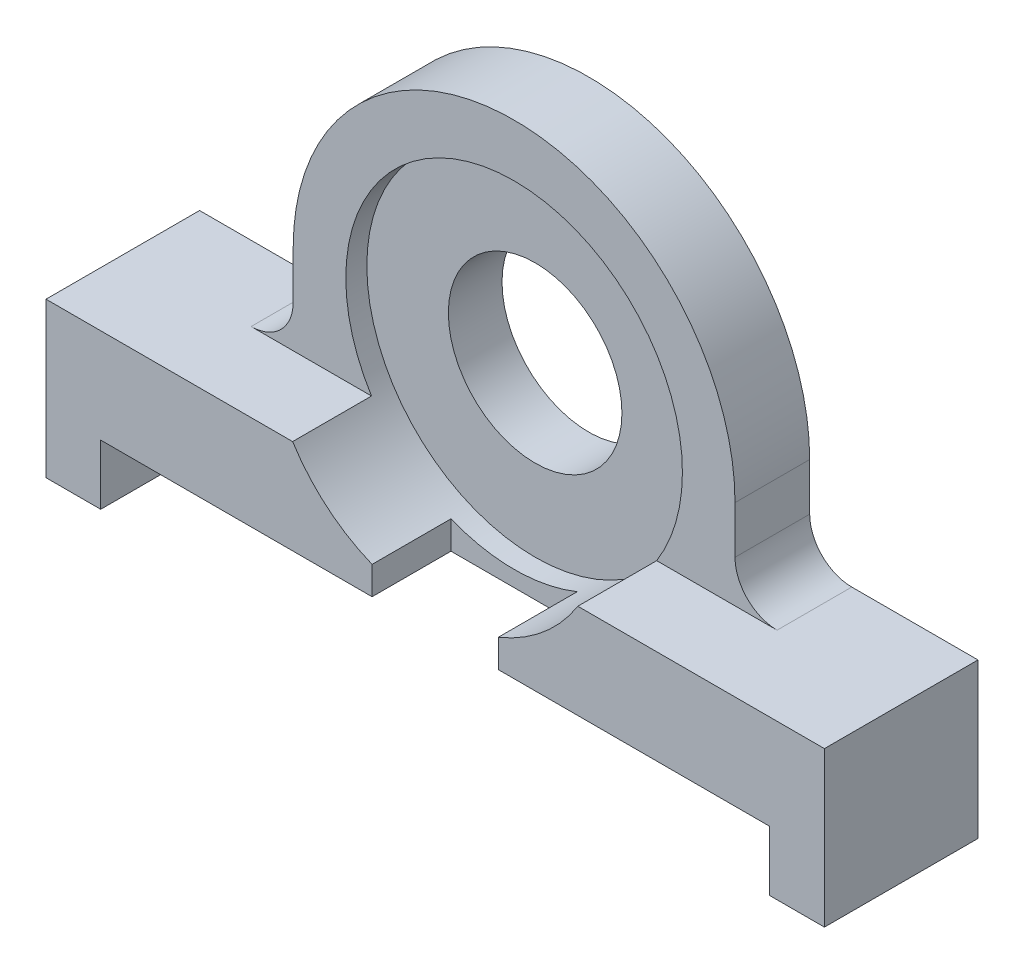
ISO-10303-21;
HEADER;
FILE_DESCRIPTION(('STEP AP214'),'2;1');
FILE_NAME('part.step','',(''),(''),'','','');
FILE_SCHEMA(('AUTOMOTIVE_DESIGN { 1 0 10303 214 1 1 1 1 }'));
ENDSEC;
DATA;
#1=APPLICATION_CONTEXT('core data for automotive mechanical design processes');
#2=APPLICATION_PROTOCOL_DEFINITION('international standard','automotive_design',2000,#1);
#3=PRODUCT_CONTEXT('',#1,'mechanical');
#4=PRODUCT('Part','Part','',(#3));
#5=PRODUCT_RELATED_PRODUCT_CATEGORY('part','',(#4));
#6=PRODUCT_DEFINITION_FORMATION('','',#4);
#7=PRODUCT_DEFINITION_CONTEXT('part definition',#1,'design');
#8=PRODUCT_DEFINITION('design','',#6,#7);
#9=PRODUCT_DEFINITION_SHAPE('','',#8);
#10=(LENGTH_UNIT() NAMED_UNIT(*) SI_UNIT(.MILLI.,.METRE.));
#11=(NAMED_UNIT(*) PLANE_ANGLE_UNIT() SI_UNIT($,.RADIAN.));
#12=(NAMED_UNIT(*) SI_UNIT($,.STERADIAN.) SOLID_ANGLE_UNIT());
#13=UNCERTAINTY_MEASURE_WITH_UNIT(LENGTH_MEASURE(1.E-05),#10,'distance_accuracy_value','');
#14=(GEOMETRIC_REPRESENTATION_CONTEXT(3) GLOBAL_UNCERTAINTY_ASSIGNED_CONTEXT((#13)) GLOBAL_UNIT_ASSIGNED_CONTEXT((#10,
#11,#12)) REPRESENTATION_CONTEXT('',''));
#15=CARTESIAN_POINT('',(0.,0.,0.));
#16=DIRECTION('',(0.,0.,1.));
#17=DIRECTION('',(1.,0.,0.));
#18=AXIS2_PLACEMENT_3D('',#15,#16,#17);
#19=CARTESIAN_POINT('',(0.,23.2,12.));
#20=DIRECTION('',(0.,0.,-1.));
#21=DIRECTION('',(-1.,0.,0.));
#22=AXIS2_PLACEMENT_3D('',#19,#20,#21);
#23=PLANE('',#22);
#24=DIRECTION('',(-1.,0.,0.));
#25=VECTOR('',#24,1.);
#26=CARTESIAN_POINT('',(-21.8,5.70000000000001,12.));
#27=LINE('',#26,#25);
#28=CARTESIAN_POINT('',(-6.,5.70000000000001,12.));
#29=VERTEX_POINT('',#28);
#30=CARTESIAN_POINT('',(-31.8,5.70000000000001,12.));
#31=VERTEX_POINT('',#30);
#32=EDGE_CURVE('E448',#29,#31,#27,.T.);
#33=ORIENTED_EDGE('',*,*,#32,.F.);
#34=DIRECTION('',(0.,-1.,0.));
#35=VECTOR('',#34,1.);
#36=CARTESIAN_POINT('',(-6.,5.70000000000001,12.));
#37=LINE('',#36,#35);
#38=CARTESIAN_POINT('',(-6.,8.36760302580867,12.));
#39=VERTEX_POINT('',#38);
#40=EDGE_CURVE('E344',#39,#29,#37,.T.);
#41=ORIENTED_EDGE('',*,*,#40,.F.);
#42=CARTESIAN_POINT('',(0.,23.2,12.));
#43=DIRECTION('',(0.,0.,1.));
#44=DIRECTION('',(1.,0.,0.));
#45=AXIS2_PLACEMENT_3D('',#42,#43,#44);
#46=CIRCLE('',#45,16.);
#47=CARTESIAN_POINT('',(-13.555441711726,14.7,12.));
#48=VERTEX_POINT('',#47);
#49=EDGE_CURVE('E493',#48,#39,#46,.T.);
#50=ORIENTED_EDGE('',*,*,#49,.F.);
#51=DIRECTION('',(-1.,0.,0.));
#52=VECTOR('',#51,1.);
#53=CARTESIAN_POINT('',(-21.,14.7,12.));
#54=LINE('',#53,#52);
#55=CARTESIAN_POINT('',(-37.,14.7,12.));
#56=VERTEX_POINT('',#55);
#57=EDGE_CURVE('E504',#48,#56,#54,.T.);
#58=ORIENTED_EDGE('',*,*,#57,.T.);
#59=DIRECTION('',(0.,-1.,0.));
#60=VECTOR('',#59,1.);
#61=CARTESIAN_POINT('',(-37.,14.7,12.));
#62=LINE('',#61,#60);
#63=CARTESIAN_POINT('',(-37.,0.,12.));
#64=VERTEX_POINT('',#63);
#65=EDGE_CURVE('E506',#56,#64,#62,.T.);
#66=ORIENTED_EDGE('',*,*,#65,.T.);
#67=DIRECTION('',(1.,0.,0.));
#68=VECTOR('',#67,1.);
#69=CARTESIAN_POINT('',(-37.,0.,12.));
#70=LINE('',#69,#68);
#71=CARTESIAN_POINT('',(-31.8,0.,12.));
#72=VERTEX_POINT('',#71);
#73=EDGE_CURVE('E497',#64,#72,#70,.T.);
#74=ORIENTED_EDGE('',*,*,#73,.T.);
#75=DIRECTION('',(0.,-1.,0.));
#76=VECTOR('',#75,1.);
#77=CARTESIAN_POINT('',(-31.8,0.,12.));
#78=LINE('',#77,#76);
#79=EDGE_CURVE('E366',#31,#72,#78,.T.);
#80=ORIENTED_EDGE('',*,*,#79,.F.);
#81=EDGE_LOOP('',(#33,#41,#50,#58,#66,#74,#80));
#82=FACE_BOUND('',#81,.T.);
#83=ADVANCED_FACE('F38',(#82),#23,.F.);
#84=CARTESIAN_POINT('',(21.,23.2,12.));
#85=DIRECTION('',(-1.,0.,0.));
#86=DIRECTION('',(0.,-1.,0.));
#87=AXIS2_PLACEMENT_3D('',#84,#85,#86);
#88=PLANE('',#87);
#89=DIRECTION('',(0.,-1.,0.));
#90=VECTOR('',#89,1.);
#91=CARTESIAN_POINT('',(21.,14.7,4.5));
#92=LINE('',#91,#90);
#93=CARTESIAN_POINT('',(21.,23.2,4.5));
#94=VERTEX_POINT('',#93);
#95=CARTESIAN_POINT('',(21.,18.7,4.5));
#96=VERTEX_POINT('',#95);
#97=EDGE_CURVE('E409',#94,#96,#92,.T.);
#98=ORIENTED_EDGE('',*,*,#97,.T.);
#99=DIRECTION('',(0.,0.,-1.));
#100=VECTOR('',#99,1.);
#101=CARTESIAN_POINT('',(21.,18.7,0.));
#102=LINE('',#101,#100);
#103=CARTESIAN_POINT('',(21.,18.7,-2.6));
#104=VERTEX_POINT('',#103);
#105=EDGE_CURVE('E540',#96,#104,#102,.T.);
#106=ORIENTED_EDGE('',*,*,#105,.T.);
#107=DIRECTION('',(0.,-1.,0.));
#108=VECTOR('',#107,1.);
#109=CARTESIAN_POINT('',(21.,18.7,-2.6));
#110=LINE('',#109,#108);
#111=CARTESIAN_POINT('',(21.,23.2,-2.6));
#112=VERTEX_POINT('',#111);
#113=EDGE_CURVE('E338',#112,#104,#110,.T.);
#114=ORIENTED_EDGE('',*,*,#113,.F.);
#115=DIRECTION('',(0.,0.,-1.));
#116=VECTOR('',#115,1.);
#117=CARTESIAN_POINT('',(21.,23.2,12.));
#118=LINE('',#117,#116);
#119=EDGE_CURVE('E514',#94,#112,#118,.T.);
#120=ORIENTED_EDGE('',*,*,#119,.F.);
#121=EDGE_LOOP('',(#98,#106,#114,#120));
#122=FACE_BOUND('',#121,.T.);
#123=ADVANCED_FACE('F556',(#122),#88,.F.);
#124=CARTESIAN_POINT('',(0.,23.2,12.));
#125=DIRECTION('',(0.,0.,-1.));
#126=DIRECTION('',(-1.,0.,0.));
#127=AXIS2_PLACEMENT_3D('',#124,#125,#126);
#128=CYLINDRICAL_SURFACE('',#127,21.);
#129=CARTESIAN_POINT('',(0.,23.2,4.5));
#130=DIRECTION('',(0.,0.,1.));
#131=DIRECTION('',(1.,0.,0.));
#132=AXIS2_PLACEMENT_3D('',#129,#130,#131);
#133=CIRCLE('',#132,21.);
#134=CARTESIAN_POINT('',(-21.,23.2,4.5));
#135=VERTEX_POINT('',#134);
#136=EDGE_CURVE('E385',#135,#94,#133,.F.);
#137=ORIENTED_EDGE('',*,*,#136,.T.);
#138=ORIENTED_EDGE('',*,*,#119,.T.);
#139=CARTESIAN_POINT('',(0.,23.2,-2.6));
#140=DIRECTION('',(0.,0.,-1.));
#141=DIRECTION('',(-1.,0.,0.));
#142=AXIS2_PLACEMENT_3D('',#139,#140,#141);
#143=CIRCLE('',#142,21.);
#144=CARTESIAN_POINT('',(-21.,23.2,-2.6));
#145=VERTEX_POINT('',#144);
#146=EDGE_CURVE('E335',#145,#112,#143,.T.);
#147=ORIENTED_EDGE('',*,*,#146,.F.);
#148=DIRECTION('',(0.,0.,-1.));
#149=VECTOR('',#148,1.);
#150=CARTESIAN_POINT('',(-21.,23.2,12.));
#151=LINE('',#150,#149);
#152=EDGE_CURVE('E512',#135,#145,#151,.T.);
#153=ORIENTED_EDGE('',*,*,#152,.F.);
#154=EDGE_LOOP('',(#137,#138,#147,#153));
#155=FACE_BOUND('',#154,.T.);
#156=ADVANCED_FACE('F659',(#155),#128,.T.);
#157=CARTESIAN_POINT('',(-21.,14.7,12.));
#158=DIRECTION('',(1.,0.,0.));
#159=DIRECTION('',(0.,0.,-1.));
#160=AXIS2_PLACEMENT_3D('',#157,#158,#159);
#161=PLANE('',#160);
#162=ORIENTED_EDGE('',*,*,#152,.T.);
#163=DIRECTION('',(0.,1.,0.));
#164=VECTOR('',#163,1.);
#165=CARTESIAN_POINT('',(-21.,23.2,-2.6));
#166=LINE('',#165,#164);
#167=CARTESIAN_POINT('',(-21.,18.7,-2.6));
#168=VERTEX_POINT('',#167);
#169=EDGE_CURVE('E332',#168,#145,#166,.T.);
#170=ORIENTED_EDGE('',*,*,#169,.F.);
#171=DIRECTION('',(0.,0.,-1.));
#172=VECTOR('',#171,1.);
#173=CARTESIAN_POINT('',(-21.,18.7,4.5));
#174=LINE('',#173,#172);
#175=CARTESIAN_POINT('',(-21.,18.7,4.5));
#176=VERTEX_POINT('',#175);
#177=EDGE_CURVE('E547',#168,#176,#174,.F.);
#178=ORIENTED_EDGE('',*,*,#177,.T.);
#179=DIRECTION('',(0.,1.,0.));
#180=VECTOR('',#179,1.);
#181=CARTESIAN_POINT('',(-21.,23.2,4.5));
#182=LINE('',#181,#180);
#183=EDGE_CURVE('E403',#176,#135,#182,.T.);
#184=ORIENTED_EDGE('',*,*,#183,.T.);
#185=EDGE_LOOP('',(#162,#170,#178,#184));
#186=FACE_BOUND('',#185,.T.);
#187=ADVANCED_FACE('F655',(#186),#161,.F.);
#188=CARTESIAN_POINT('',(37.,0.,12.));
#189=DIRECTION('',(0.,1.,0.));
#190=DIRECTION('',(-1.,0.,0.));
#191=AXIS2_PLACEMENT_3D('',#188,#189,#190);
#192=PLANE('',#191);
#193=CARTESIAN_POINT('',(-34.,0.,3.));
#194=DIRECTION('',(0.,-1.,0.));
#195=DIRECTION('',(1.,0.,0.));
#196=AXIS2_PLACEMENT_3D('',#193,#194,#195);
#197=CIRCLE('',#196,1.25);
#198=CARTESIAN_POINT('',(-32.75,0.,3.));
#199=VERTEX_POINT('',#198);
#200=EDGE_CURVE('E417',#199,#199,#197,.T.);
#201=ORIENTED_EDGE('',*,*,#200,.F.);
#202=EDGE_LOOP('',(#201));
#203=FACE_BOUND('',#202,.T.);
#204=CARTESIAN_POINT('',(-34.,0.,9.));
#205=DIRECTION('',(0.,-1.,0.));
#206=DIRECTION('',(1.,0.,0.));
#207=AXIS2_PLACEMENT_3D('',#204,#205,#206);
#208=CIRCLE('',#207,1.25);
#209=CARTESIAN_POINT('',(-32.75,0.,9.));
#210=VERTEX_POINT('',#209);
#211=EDGE_CURVE('E416',#210,#210,#208,.T.);
#212=ORIENTED_EDGE('',*,*,#211,.F.);
#213=EDGE_LOOP('',(#212));
#214=FACE_BOUND('',#213,.T.);
#215=DIRECTION('',(1.,0.,0.));
#216=VECTOR('',#215,1.);
#217=CARTESIAN_POINT('',(-21.8,0.,5.));
#218=LINE('',#217,#216);
#219=CARTESIAN_POINT('',(-31.8,0.,5.));
#220=VERTEX_POINT('',#219);
#221=CARTESIAN_POINT('',(-21.8,0.,5.));
#222=VERTEX_POINT('',#221);
#223=EDGE_CURVE('E387',#220,#222,#218,.T.);
#224=ORIENTED_EDGE('',*,*,#223,.F.);
#225=DIRECTION('',(0.,0.,1.));
#226=VECTOR('',#225,1.);
#227=CARTESIAN_POINT('',(-31.8,0.,5.));
#228=LINE('',#227,#226);
#229=EDGE_CURVE('E381',#220,#72,#228,.T.);
#230=ORIENTED_EDGE('',*,*,#229,.T.);
#231=ORIENTED_EDGE('',*,*,#73,.F.);
#232=DIRECTION('',(0.,0.,-1.));
#233=VECTOR('',#232,1.);
#234=CARTESIAN_POINT('',(-37.,0.,12.));
#235=LINE('',#234,#233);
#236=CARTESIAN_POINT('',(-37.,0.,-2.6));
#237=VERTEX_POINT('',#236);
#238=EDGE_CURVE('E508',#64,#237,#235,.T.);
#239=ORIENTED_EDGE('',*,*,#238,.T.);
#240=DIRECTION('',(-1.,0.,0.));
#241=VECTOR('',#240,1.);
#242=CARTESIAN_POINT('',(-37.,0.,-2.6));
#243=LINE('',#242,#241);
#244=CARTESIAN_POINT('',(-34.1,0.,-2.6));
#245=VERTEX_POINT('',#244);
#246=EDGE_CURVE('E320',#245,#237,#243,.T.);
#247=ORIENTED_EDGE('',*,*,#246,.F.);
#248=DIRECTION('',(0.,0.,-1.));
#249=VECTOR('',#248,1.);
#250=CARTESIAN_POINT('',(-34.1,0.,1.));
#251=LINE('',#250,#249);
#252=CARTESIAN_POINT('',(-34.1,0.,1.));
#253=VERTEX_POINT('',#252);
#254=EDGE_CURVE('E487',#253,#245,#251,.T.);
#255=ORIENTED_EDGE('',*,*,#254,.F.);
#256=DIRECTION('',(1.,0.,0.));
#257=VECTOR('',#256,1.);
#258=CARTESIAN_POINT('',(-34.1,0.,1.));
#259=LINE('',#258,#257);
#260=CARTESIAN_POINT('',(-21.8,0.,1.));
#261=VERTEX_POINT('',#260);
#262=EDGE_CURVE('E461',#253,#261,#259,.T.);
#263=ORIENTED_EDGE('',*,*,#262,.T.);
#264=DIRECTION('',(0.,0.,-1.));
#265=VECTOR('',#264,1.);
#266=CARTESIAN_POINT('',(-21.8,0.,12.001));
#267=LINE('',#266,#265);
#268=EDGE_CURVE('E446',#222,#261,#267,.T.);
#269=ORIENTED_EDGE('',*,*,#268,.F.);
#270=EDGE_LOOP('',(#224,#230,#231,#239,#247,#255,#263,#269));
#271=FACE_BOUND('',#270,.T.);
#272=ADVANCED_FACE('F635',(#203,#214,#271),#192,.F.);
#273=CARTESIAN_POINT('',(34.,0.,9.));
#274=DIRECTION('',(0.,-1.,0.));
#275=DIRECTION('',(-1.,0.,0.));
#276=AXIS2_PLACEMENT_3D('',#273,#274,#275);
#277=CIRCLE('',#276,1.25);
#278=CARTESIAN_POINT('',(32.75,0.,9.));
#279=VERTEX_POINT('',#278);
#280=EDGE_CURVE('E412',#279,#279,#277,.T.);
#281=ORIENTED_EDGE('',*,*,#280,.F.);
#282=EDGE_LOOP('',(#281));
#283=FACE_BOUND('',#282,.T.);
#284=CARTESIAN_POINT('',(34.,0.,3.));
#285=DIRECTION('',(0.,-1.,0.));
#286=DIRECTION('',(-1.,0.,0.));
#287=AXIS2_PLACEMENT_3D('',#284,#285,#286);
#288=CIRCLE('',#287,1.25);
#289=CARTESIAN_POINT('',(32.75,0.,3.));
#290=VERTEX_POINT('',#289);
#291=EDGE_CURVE('E423',#290,#290,#288,.T.);
#292=ORIENTED_EDGE('',*,*,#291,.F.);
#293=EDGE_LOOP('',(#292));
#294=FACE_BOUND('',#293,.T.);
#295=CARTESIAN_POINT('',(31.8,0.,12.));
#296=VERTEX_POINT('',#295);
#297=CARTESIAN_POINT('',(37.,0.,12.));
#298=VERTEX_POINT('',#297);
#299=EDGE_CURVE('E496',#296,#298,#70,.T.);
#300=ORIENTED_EDGE('',*,*,#299,.F.);
#301=DIRECTION('',(0.,0.,1.));
#302=VECTOR('',#301,1.);
#303=CARTESIAN_POINT('',(31.8,0.,5.));
#304=LINE('',#303,#302);
#305=CARTESIAN_POINT('',(31.8,0.,5.));
#306=VERTEX_POINT('',#305);
#307=EDGE_CURVE('E378',#306,#296,#304,.T.);
#308=ORIENTED_EDGE('',*,*,#307,.F.);
#309=DIRECTION('',(1.,0.,0.));
#310=VECTOR('',#309,1.);
#311=CARTESIAN_POINT('',(21.8,0.,5.));
#312=LINE('',#311,#310);
#313=CARTESIAN_POINT('',(21.8,0.,5.));
#314=VERTEX_POINT('',#313);
#315=EDGE_CURVE('E369',#314,#306,#312,.T.);
#316=ORIENTED_EDGE('',*,*,#315,.F.);
#317=DIRECTION('',(0.,0.,-1.));
#318=VECTOR('',#317,1.);
#319=CARTESIAN_POINT('',(21.8,0.,12.001));
#320=LINE('',#319,#318);
#321=CARTESIAN_POINT('',(21.8,0.,1.));
#322=VERTEX_POINT('',#321);
#323=EDGE_CURVE('E449',#314,#322,#320,.T.);
#324=ORIENTED_EDGE('',*,*,#323,.T.);
#325=CARTESIAN_POINT('',(34.1,0.,1.));
#326=VERTEX_POINT('',#325);
#327=EDGE_CURVE('E460',#322,#326,#259,.T.);
#328=ORIENTED_EDGE('',*,*,#327,.T.);
#329=DIRECTION('',(0.,0.,-1.));
#330=VECTOR('',#329,1.);
#331=CARTESIAN_POINT('',(34.1,0.,1.));
#332=LINE('',#331,#330);
#333=CARTESIAN_POINT('',(34.1,0.,-2.6));
#334=VERTEX_POINT('',#333);
#335=EDGE_CURVE('E278',#326,#334,#332,.T.);
#336=ORIENTED_EDGE('',*,*,#335,.T.);
#337=DIRECTION('',(-1.,0.,0.));
#338=VECTOR('',#337,1.);
#339=CARTESIAN_POINT('',(34.1,0.,-2.6));
#340=LINE('',#339,#338);
#341=CARTESIAN_POINT('',(37.,0.,-2.6));
#342=VERTEX_POINT('',#341);
#343=EDGE_CURVE('E275',#342,#334,#340,.T.);
#344=ORIENTED_EDGE('',*,*,#343,.F.);
#345=DIRECTION('',(0.,0.,-1.));
#346=VECTOR('',#345,1.);
#347=CARTESIAN_POINT('',(37.,0.,12.));
#348=LINE('',#347,#346);
#349=EDGE_CURVE('E262',#298,#342,#348,.T.);
#350=ORIENTED_EDGE('',*,*,#349,.F.);
#351=EDGE_LOOP('',(#300,#308,#316,#324,#328,#336,#344,#350));
#352=FACE_BOUND('',#351,.T.);
#353=ADVANCED_FACE('F276',(#283,#294,#352),#192,.F.);
#354=CARTESIAN_POINT('',(6.,8.36760302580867,12.));
#355=VERTEX_POINT('',#354);
#356=CARTESIAN_POINT('',(13.555441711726,14.7,12.));
#357=VERTEX_POINT('',#356);
#358=EDGE_CURVE('E492',#355,#357,#46,.T.);
#359=ORIENTED_EDGE('',*,*,#358,.F.);
#360=DIRECTION('',(0.,1.,0.));
#361=VECTOR('',#360,1.);
#362=CARTESIAN_POINT('',(6.,5.70000000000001,12.));
#363=LINE('',#362,#361);
#364=CARTESIAN_POINT('',(6.,5.70000000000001,12.));
#365=VERTEX_POINT('',#364);
#366=EDGE_CURVE('E352',#365,#355,#363,.T.);
#367=ORIENTED_EDGE('',*,*,#366,.F.);
#368=CARTESIAN_POINT('',(31.8,5.70000000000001,12.));
#369=VERTEX_POINT('',#368);
#370=EDGE_CURVE('E454',#369,#365,#27,.T.);
#371=ORIENTED_EDGE('',*,*,#370,.F.);
#372=DIRECTION('',(0.,1.,0.));
#373=VECTOR('',#372,1.);
#374=CARTESIAN_POINT('',(31.8,0.,12.));
#375=LINE('',#374,#373);
#376=EDGE_CURVE('E370',#296,#369,#375,.T.);
#377=ORIENTED_EDGE('',*,*,#376,.F.);
#378=ORIENTED_EDGE('',*,*,#299,.T.);
#379=DIRECTION('',(0.,1.,0.));
#380=VECTOR('',#379,1.);
#381=CARTESIAN_POINT('',(37.,14.7,12.));
#382=LINE('',#381,#380);
#383=CARTESIAN_POINT('',(37.,14.7,12.));
#384=VERTEX_POINT('',#383);
#385=EDGE_CURVE('E268',#298,#384,#382,.T.);
#386=ORIENTED_EDGE('',*,*,#385,.T.);
#387=DIRECTION('',(-1.,0.,0.));
#388=VECTOR('',#387,1.);
#389=CARTESIAN_POINT('',(21.,14.7,12.));
#390=LINE('',#389,#388);
#391=EDGE_CURVE('E501',#384,#357,#390,.T.);
#392=ORIENTED_EDGE('',*,*,#391,.T.);
#393=EDGE_LOOP('',(#359,#367,#371,#377,#378,#386,#392));
#394=FACE_BOUND('',#393,.T.);
#395=ADVANCED_FACE('F566',(#394),#23,.F.);
#396=CARTESIAN_POINT('',(37.,14.7,12.));
#397=DIRECTION('',(-1.,0.,0.));
#398=DIRECTION('',(0.,0.,1.));
#399=AXIS2_PLACEMENT_3D('',#396,#397,#398);
#400=PLANE('',#399);
#401=ORIENTED_EDGE('',*,*,#349,.T.);
#402=DIRECTION('',(0.,-1.,0.));
#403=VECTOR('',#402,1.);
#404=CARTESIAN_POINT('',(37.,14.7,-2.6));
#405=LINE('',#404,#403);
#406=CARTESIAN_POINT('',(37.,14.7,-2.6));
#407=VERTEX_POINT('',#406);
#408=EDGE_CURVE('E267',#407,#342,#405,.T.);
#409=ORIENTED_EDGE('',*,*,#408,.F.);
#410=DIRECTION('',(0.,0.,-1.));
#411=VECTOR('',#410,1.);
#412=CARTESIAN_POINT('',(37.,14.7,12.));
#413=LINE('',#412,#411);
#414=EDGE_CURVE('E272',#384,#407,#413,.T.);
#415=ORIENTED_EDGE('',*,*,#414,.F.);
#416=ORIENTED_EDGE('',*,*,#385,.F.);
#417=EDGE_LOOP('',(#401,#409,#415,#416));
#418=FACE_BOUND('',#417,.T.);
#419=ADVANCED_FACE('F264',(#418),#400,.F.);
#420=CARTESIAN_POINT('',(21.,14.7,12.));
#421=DIRECTION('',(0.,-1.,0.));
#422=DIRECTION('',(1.,0.,0.));
#423=AXIS2_PLACEMENT_3D('',#420,#421,#422);
#424=PLANE('',#423);
#425=ORIENTED_EDGE('',*,*,#414,.T.);
#426=DIRECTION('',(1.,0.,0.));
#427=VECTOR('',#426,1.);
#428=CARTESIAN_POINT('',(37.,14.7,-2.6));
#429=LINE('',#428,#427);
#430=CARTESIAN_POINT('',(25.,14.7,-2.6));
#431=VERTEX_POINT('',#430);
#432=EDGE_CURVE('E289',#431,#407,#429,.T.);
#433=ORIENTED_EDGE('',*,*,#432,.F.);
#434=DIRECTION('',(0.,0.,-1.));
#435=VECTOR('',#434,1.);
#436=CARTESIAN_POINT('',(25.,14.7,4.5));
#437=LINE('',#436,#435);
#438=CARTESIAN_POINT('',(25.,14.7,4.5));
#439=VERTEX_POINT('',#438);
#440=EDGE_CURVE('E542',#431,#439,#437,.F.);
#441=ORIENTED_EDGE('',*,*,#440,.T.);
#442=DIRECTION('',(-1.,0.,0.));
#443=VECTOR('',#442,1.);
#444=CARTESIAN_POINT('',(-21.,14.7,4.5));
#445=LINE('',#444,#443);
#446=CARTESIAN_POINT('',(13.555441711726,14.7,4.5));
#447=VERTEX_POINT('',#446);
#448=EDGE_CURVE('E406',#439,#447,#445,.T.);
#449=ORIENTED_EDGE('',*,*,#448,.T.);
#450=DIRECTION('',(0.,0.,-1.));
#451=VECTOR('',#450,1.);
#452=CARTESIAN_POINT('',(13.555441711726,14.7,12.));
#453=LINE('',#452,#451);
#454=EDGE_CURVE('E522',#447,#357,#453,.F.);
#455=ORIENTED_EDGE('',*,*,#454,.T.);
#456=ORIENTED_EDGE('',*,*,#391,.F.);
#457=EDGE_LOOP('',(#425,#433,#441,#449,#455,#456));
#458=FACE_BOUND('',#457,.T.);
#459=ADVANCED_FACE('F561',(#458),#424,.F.);
#460=CARTESIAN_POINT('',(-21.,14.7,12.));
#461=DIRECTION('',(0.,-1.,0.));
#462=DIRECTION('',(1.,0.,0.));
#463=AXIS2_PLACEMENT_3D('',#460,#461,#462);
#464=PLANE('',#463);
#465=CARTESIAN_POINT('',(-13.555441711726,14.7,4.5));
#466=VERTEX_POINT('',#465);
#467=CARTESIAN_POINT('',(-25.,14.7,4.5));
#468=VERTEX_POINT('',#467);
#469=EDGE_CURVE('E405',#466,#468,#445,.T.);
#470=ORIENTED_EDGE('',*,*,#469,.T.);
#471=DIRECTION('',(0.,0.,-1.));
#472=VECTOR('',#471,1.);
#473=CARTESIAN_POINT('',(-25.,14.7,0.));
#474=LINE('',#473,#472);
#475=CARTESIAN_POINT('',(-25.,14.7,-2.6));
#476=VERTEX_POINT('',#475);
#477=EDGE_CURVE('E545',#468,#476,#474,.T.);
#478=ORIENTED_EDGE('',*,*,#477,.T.);
#479=DIRECTION('',(1.,0.,0.));
#480=VECTOR('',#479,1.);
#481=CARTESIAN_POINT('',(-25.,14.7,-2.6));
#482=LINE('',#481,#480);
#483=CARTESIAN_POINT('',(-37.,14.7,-2.6));
#484=VERTEX_POINT('',#483);
#485=EDGE_CURVE('E326',#484,#476,#482,.T.);
#486=ORIENTED_EDGE('',*,*,#485,.F.);
#487=DIRECTION('',(0.,0.,-1.));
#488=VECTOR('',#487,1.);
#489=CARTESIAN_POINT('',(-37.,14.7,12.));
#490=LINE('',#489,#488);
#491=EDGE_CURVE('E510',#56,#484,#490,.T.);
#492=ORIENTED_EDGE('',*,*,#491,.F.);
#493=ORIENTED_EDGE('',*,*,#57,.F.);
#494=DIRECTION('',(0.,0.,-1.));
#495=VECTOR('',#494,1.);
#496=CARTESIAN_POINT('',(-13.555441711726,14.7,12.));
#497=LINE('',#496,#495);
#498=EDGE_CURVE('E525',#48,#466,#497,.T.);
#499=ORIENTED_EDGE('',*,*,#498,.T.);
#500=EDGE_LOOP('',(#470,#478,#486,#492,#493,#499));
#501=FACE_BOUND('',#500,.T.);
#502=ADVANCED_FACE('F646',(#501),#464,.F.);
#503=CARTESIAN_POINT('',(-37.,14.7,12.));
#504=DIRECTION('',(1.,0.,0.));
#505=DIRECTION('',(0.,0.,-1.));
#506=AXIS2_PLACEMENT_3D('',#503,#504,#505);
#507=PLANE('',#506);
#508=ORIENTED_EDGE('',*,*,#491,.T.);
#509=DIRECTION('',(0.,1.,0.));
#510=VECTOR('',#509,1.);
#511=CARTESIAN_POINT('',(-37.,14.7,-2.6));
#512=LINE('',#511,#510);
#513=EDGE_CURVE('E323',#237,#484,#512,.T.);
#514=ORIENTED_EDGE('',*,*,#513,.F.);
#515=ORIENTED_EDGE('',*,*,#238,.F.);
#516=ORIENTED_EDGE('',*,*,#65,.F.);
#517=EDGE_LOOP('',(#508,#514,#515,#516));
#518=FACE_BOUND('',#517,.T.);
#519=ADVANCED_FACE('F642',(#518),#507,.F.);
#520=CARTESIAN_POINT('',(0.,23.2,12.));
#521=DIRECTION('',(0.,0.,-1.));
#522=DIRECTION('',(-1.,0.,0.));
#523=AXIS2_PLACEMENT_3D('',#520,#521,#522);
#524=CYLINDRICAL_SURFACE('',#523,16.);
#525=DIRECTION('',(0.,0.,1.));
#526=VECTOR('',#525,1.);
#527=CARTESIAN_POINT('',(-6.,8.36760302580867,-7.79292910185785));
#528=LINE('',#527,#526);
#529=CARTESIAN_POINT('',(-6.,8.36760302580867,4.5));
#530=VERTEX_POINT('',#529);
#531=EDGE_CURVE('E348',#530,#39,#528,.T.);
#532=ORIENTED_EDGE('',*,*,#531,.F.);
#533=CARTESIAN_POINT('',(0.,23.2,4.5));
#534=DIRECTION('',(0.,0.,1.));
#535=DIRECTION('',(1.,0.,0.));
#536=AXIS2_PLACEMENT_3D('',#533,#534,#535);
#537=CIRCLE('',#536,16.);
#538=CARTESIAN_POINT('',(6.,8.36760302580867,4.5));
#539=VERTEX_POINT('',#538);
#540=EDGE_CURVE('E363',#530,#539,#537,.T.);
#541=ORIENTED_EDGE('',*,*,#540,.T.);
#542=DIRECTION('',(0.,0.,1.));
#543=VECTOR('',#542,1.);
#544=CARTESIAN_POINT('',(6.,8.36760302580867,-7.79292910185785));
#545=LINE('',#544,#543);
#546=EDGE_CURVE('E355',#539,#355,#545,.T.);
#547=ORIENTED_EDGE('',*,*,#546,.T.);
#548=ORIENTED_EDGE('',*,*,#358,.T.);
#549=ORIENTED_EDGE('',*,*,#454,.F.);
#550=CARTESIAN_POINT('',(0.,23.2,4.5));
#551=DIRECTION('',(0.,0.,1.));
#552=DIRECTION('',(1.,0.,0.));
#553=AXIS2_PLACEMENT_3D('',#550,#551,#552);
#554=CIRCLE('',#553,16.);
#555=EDGE_CURVE('E519',#447,#466,#554,.T.);
#556=ORIENTED_EDGE('',*,*,#555,.T.);
#557=ORIENTED_EDGE('',*,*,#498,.F.);
#558=ORIENTED_EDGE('',*,*,#49,.T.);
#559=EDGE_LOOP('',(#532,#541,#547,#548,#549,#556,#557,#558));
#560=FACE_BOUND('',#559,.T.);
#561=CARTESIAN_POINT('',(0.,23.2,2.5));
#562=DIRECTION('',(0.,0.,1.));
#563=DIRECTION('',(1.,0.,0.));
#564=AXIS2_PLACEMENT_3D('',#561,#562,#563);
#565=CIRCLE('',#564,16.);
#566=CARTESIAN_POINT('',(16.,23.2,2.5));
#567=VERTEX_POINT('',#566);
#568=EDGE_CURVE('E271',#567,#567,#565,.T.);
#569=ORIENTED_EDGE('',*,*,#568,.F.);
#570=EDGE_LOOP('',(#569));
#571=FACE_BOUND('',#570,.T.);
#572=ADVANCED_FACE('F776',(#560,#571),#524,.F.);
#573=CARTESIAN_POINT('',(0.,23.2,2.5));
#574=DIRECTION('',(0.,0.,1.));
#575=DIRECTION('',(1.,0.,0.));
#576=AXIS2_PLACEMENT_3D('',#573,#574,#575);
#577=PLANE('',#576);
#578=ORIENTED_EDGE('',*,*,#568,.T.);
#579=EDGE_LOOP('',(#578));
#580=FACE_BOUND('',#579,.T.);
#581=CARTESIAN_POINT('',(0.,23.2,2.5));
#582=DIRECTION('',(0.,0.,1.));
#583=DIRECTION('',(1.,0.,0.));
#584=AXIS2_PLACEMENT_3D('',#581,#582,#583);
#585=CIRCLE('',#584,8.25);
#586=CARTESIAN_POINT('',(8.25,23.2,2.5));
#587=VERTEX_POINT('',#586);
#588=EDGE_CURVE('E489',#587,#587,#585,.T.);
#589=ORIENTED_EDGE('',*,*,#588,.F.);
#590=EDGE_LOOP('',(#589));
#591=FACE_BOUND('',#590,.T.);
#592=ADVANCED_FACE('F773',(#580,#591),#577,.T.);
#593=CARTESIAN_POINT('',(0.,23.2,2.5));
#594=DIRECTION('',(0.,0.,-1.));
#595=DIRECTION('',(-1.,0.,0.));
#596=AXIS2_PLACEMENT_3D('',#593,#594,#595);
#597=CYLINDRICAL_SURFACE('',#596,8.25);
#598=ORIENTED_EDGE('',*,*,#588,.T.);
#599=EDGE_LOOP('',(#598));
#600=FACE_BOUND('',#599,.T.);
#601=CARTESIAN_POINT('',(0.,23.2,-2.6));
#602=DIRECTION('',(0.,0.,-1.));
#603=DIRECTION('',(-1.,0.,0.));
#604=AXIS2_PLACEMENT_3D('',#601,#602,#603);
#605=CIRCLE('',#604,8.25);
#606=CARTESIAN_POINT('',(-8.25,23.2,-2.6));
#607=VERTEX_POINT('',#606);
#608=EDGE_CURVE('E290',#607,#607,#605,.T.);
#609=ORIENTED_EDGE('',*,*,#608,.T.);
#610=EDGE_LOOP('',(#609));
#611=FACE_BOUND('',#610,.T.);
#612=ADVANCED_FACE('F770',(#600,#611),#597,.F.);
#613=CARTESIAN_POINT('',(-34.1,7.2,1.));
#614=DIRECTION('',(1.,0.,0.));
#615=DIRECTION('',(0.,1.,0.));
#616=AXIS2_PLACEMENT_3D('',#613,#614,#615);
#617=PLANE('',#616);
#618=ORIENTED_EDGE('',*,*,#254,.T.);
#619=DIRECTION('',(0.,-1.,0.));
#620=VECTOR('',#619,1.);
#621=CARTESIAN_POINT('',(-34.1,7.2,-2.6));
#622=LINE('',#621,#620);
#623=CARTESIAN_POINT('',(-34.1,7.2,-2.6));
#624=VERTEX_POINT('',#623);
#625=EDGE_CURVE('E317',#624,#245,#622,.T.);
#626=ORIENTED_EDGE('',*,*,#625,.F.);
#627=DIRECTION('',(0.,0.,-1.));
#628=VECTOR('',#627,1.);
#629=CARTESIAN_POINT('',(-34.1,7.2,1.));
#630=LINE('',#629,#628);
#631=CARTESIAN_POINT('',(-34.1,7.2,1.));
#632=VERTEX_POINT('',#631);
#633=EDGE_CURVE('E478',#632,#624,#630,.T.);
#634=ORIENTED_EDGE('',*,*,#633,.F.);
#635=DIRECTION('',(0.,-1.,0.));
#636=VECTOR('',#635,1.);
#637=CARTESIAN_POINT('',(-34.1,7.2,1.));
#638=LINE('',#637,#636);
#639=EDGE_CURVE('E457',#632,#253,#638,.T.);
#640=ORIENTED_EDGE('',*,*,#639,.T.);
#641=EDGE_LOOP('',(#618,#626,#634,#640));
#642=FACE_BOUND('',#641,.T.);
#643=ADVANCED_FACE('F630',(#642),#617,.T.);
#644=CARTESIAN_POINT('',(34.1,7.2,1.));
#645=DIRECTION('',(-1.,0.,0.));
#646=DIRECTION('',(0.,-1.,0.));
#647=AXIS2_PLACEMENT_3D('',#644,#645,#646);
#648=PLANE('',#647);
#649=DIRECTION('',(0.,0.,-1.));
#650=VECTOR('',#649,1.);
#651=CARTESIAN_POINT('',(34.1,7.2,1.));
#652=LINE('',#651,#650);
#653=CARTESIAN_POINT('',(34.1,7.2,1.));
#654=VERTEX_POINT('',#653);
#655=CARTESIAN_POINT('',(34.1,7.2,-2.6));
#656=VERTEX_POINT('',#655);
#657=EDGE_CURVE('E484',#654,#656,#652,.T.);
#658=ORIENTED_EDGE('',*,*,#657,.T.);
#659=DIRECTION('',(0.,1.,0.));
#660=VECTOR('',#659,1.);
#661=CARTESIAN_POINT('',(34.1,0.,-2.6));
#662=LINE('',#661,#660);
#663=EDGE_CURVE('E282',#334,#656,#662,.T.);
#664=ORIENTED_EDGE('',*,*,#663,.F.);
#665=ORIENTED_EDGE('',*,*,#335,.F.);
#666=DIRECTION('',(0.,1.,0.));
#667=VECTOR('',#666,1.);
#668=CARTESIAN_POINT('',(34.1,7.2,1.));
#669=LINE('',#668,#667);
#670=EDGE_CURVE('E464',#326,#654,#669,.T.);
#671=ORIENTED_EDGE('',*,*,#670,.T.);
#672=EDGE_LOOP('',(#658,#664,#665,#671));
#673=FACE_BOUND('',#672,.T.);
#674=ADVANCED_FACE('F596',(#673),#648,.T.);
#675=CARTESIAN_POINT('',(27.,7.2,1.));
#676=DIRECTION('',(0.,-1.,0.));
#677=DIRECTION('',(0.,0.,-1.));
#678=AXIS2_PLACEMENT_3D('',#675,#676,#677);
#679=PLANE('',#678);
#680=DIRECTION('',(0.,0.,-1.));
#681=VECTOR('',#680,1.);
#682=CARTESIAN_POINT('',(27.,7.2,1.));
#683=LINE('',#682,#681);
#684=CARTESIAN_POINT('',(27.,7.2,1.));
#685=VERTEX_POINT('',#684);
#686=CARTESIAN_POINT('',(27.,7.2,-2.6));
#687=VERTEX_POINT('',#686);
#688=EDGE_CURVE('E482',#685,#687,#683,.T.);
#689=ORIENTED_EDGE('',*,*,#688,.T.);
#690=DIRECTION('',(-1.,0.,0.));
#691=VECTOR('',#690,1.);
#692=CARTESIAN_POINT('',(34.1,7.2,-2.6));
#693=LINE('',#692,#691);
#694=EDGE_CURVE('E296',#656,#687,#693,.T.);
#695=ORIENTED_EDGE('',*,*,#694,.F.);
#696=ORIENTED_EDGE('',*,*,#657,.F.);
#697=DIRECTION('',(-1.,0.,0.));
#698=VECTOR('',#697,1.);
#699=CARTESIAN_POINT('',(27.,7.2,1.));
#700=LINE('',#699,#698);
#701=EDGE_CURVE('E466',#654,#685,#700,.T.);
#702=ORIENTED_EDGE('',*,*,#701,.T.);
#703=EDGE_LOOP('',(#689,#695,#696,#702));
#704=FACE_BOUND('',#703,.T.);
#705=ADVANCED_FACE('F600',(#704),#679,.T.);
#706=CARTESIAN_POINT('',(27.,7.2,1.));
#707=DIRECTION('',(-1.,0.,0.));
#708=DIRECTION('',(0.,-1.,0.));
#709=AXIS2_PLACEMENT_3D('',#706,#707,#708);
#710=PLANE('',#709);
#711=DIRECTION('',(0.,1.,0.));
#712=VECTOR('',#711,1.);
#713=CARTESIAN_POINT('',(27.,7.2,1.));
#714=LINE('',#713,#712);
#715=CARTESIAN_POINT('',(27.,8.55,1.));
#716=VERTEX_POINT('',#715);
#717=EDGE_CURVE('E468',#685,#716,#714,.T.);
#718=ORIENTED_EDGE('',*,*,#717,.T.);
#719=DIRECTION('',(0.,0.,-1.));
#720=VECTOR('',#719,1.);
#721=CARTESIAN_POINT('',(27.,8.55,0.));
#722=LINE('',#721,#720);
#723=CARTESIAN_POINT('',(27.,8.55,-2.6));
#724=VERTEX_POINT('',#723);
#725=EDGE_CURVE('E538',#716,#724,#722,.T.);
#726=ORIENTED_EDGE('',*,*,#725,.T.);
#727=DIRECTION('',(0.,1.,0.));
#728=VECTOR('',#727,1.);
#729=CARTESIAN_POINT('',(27.,7.2,-2.6));
#730=LINE('',#729,#728);
#731=EDGE_CURVE('E299',#687,#724,#730,.T.);
#732=ORIENTED_EDGE('',*,*,#731,.F.);
#733=ORIENTED_EDGE('',*,*,#688,.F.);
#734=EDGE_LOOP('',(#718,#726,#732,#733));
#735=FACE_BOUND('',#734,.T.);
#736=ADVANCED_FACE('F603',(#735),#710,.T.);
#737=CARTESIAN_POINT('',(-27.,10.55,1.));
#738=DIRECTION('',(0.,-1.,0.));
#739=DIRECTION('',(0.,0.,-1.));
#740=AXIS2_PLACEMENT_3D('',#737,#738,#739);
#741=PLANE('',#740);
#742=DIRECTION('',(-1.,0.,0.));
#743=VECTOR('',#742,1.);
#744=CARTESIAN_POINT('',(-27.,10.55,1.));
#745=LINE('',#744,#743);
#746=CARTESIAN_POINT('',(25.,10.55,1.));
#747=VERTEX_POINT('',#746);
#748=CARTESIAN_POINT('',(-25.,10.55,1.));
#749=VERTEX_POINT('',#748);
#750=EDGE_CURVE('E471',#747,#749,#745,.T.);
#751=ORIENTED_EDGE('',*,*,#750,.T.);
#752=DIRECTION('',(0.,0.,-1.));
#753=VECTOR('',#752,1.);
#754=CARTESIAN_POINT('',(-25.,10.55,0.));
#755=LINE('',#754,#753);
#756=CARTESIAN_POINT('',(-25.,10.55,-2.6));
#757=VERTEX_POINT('',#756);
#758=EDGE_CURVE('E530',#749,#757,#755,.T.);
#759=ORIENTED_EDGE('',*,*,#758,.T.);
#760=DIRECTION('',(-1.,0.,0.));
#761=VECTOR('',#760,1.);
#762=CARTESIAN_POINT('',(25.,10.55,-2.6));
#763=LINE('',#762,#761);
#764=CARTESIAN_POINT('',(25.,10.55,-2.6));
#765=VERTEX_POINT('',#764);
#766=EDGE_CURVE('E305',#765,#757,#763,.T.);
#767=ORIENTED_EDGE('',*,*,#766,.F.);
#768=DIRECTION('',(0.,0.,-1.));
#769=VECTOR('',#768,1.);
#770=CARTESIAN_POINT('',(25.,10.55,1.));
#771=LINE('',#770,#769);
#772=EDGE_CURVE('E528',#765,#747,#771,.F.);
#773=ORIENTED_EDGE('',*,*,#772,.T.);
#774=EDGE_LOOP('',(#751,#759,#767,#773));
#775=FACE_BOUND('',#774,.T.);
#776=ADVANCED_FACE('F613',(#775),#741,.T.);
#777=CARTESIAN_POINT('',(-27.,7.2,1.));
#778=DIRECTION('',(1.,0.,0.));
#779=DIRECTION('',(0.,1.,0.));
#780=AXIS2_PLACEMENT_3D('',#777,#778,#779);
#781=PLANE('',#780);
#782=DIRECTION('',(0.,0.,-1.));
#783=VECTOR('',#782,1.);
#784=CARTESIAN_POINT('',(-27.,7.2,1.));
#785=LINE('',#784,#783);
#786=CARTESIAN_POINT('',(-27.,7.2,1.));
#787=VERTEX_POINT('',#786);
#788=CARTESIAN_POINT('',(-27.,7.2,-2.6));
#789=VERTEX_POINT('',#788);
#790=EDGE_CURVE('E480',#787,#789,#785,.T.);
#791=ORIENTED_EDGE('',*,*,#790,.T.);
#792=DIRECTION('',(0.,-1.,0.));
#793=VECTOR('',#792,1.);
#794=CARTESIAN_POINT('',(-27.,8.55,-2.6));
#795=LINE('',#794,#793);
#796=CARTESIAN_POINT('',(-27.,8.55,-2.6));
#797=VERTEX_POINT('',#796);
#798=EDGE_CURVE('E311',#797,#789,#795,.T.);
#799=ORIENTED_EDGE('',*,*,#798,.F.);
#800=DIRECTION('',(0.,0.,-1.));
#801=VECTOR('',#800,1.);
#802=CARTESIAN_POINT('',(-27.,8.55,1.));
#803=LINE('',#802,#801);
#804=CARTESIAN_POINT('',(-27.,8.55,1.));
#805=VERTEX_POINT('',#804);
#806=EDGE_CURVE('E532',#797,#805,#803,.F.);
#807=ORIENTED_EDGE('',*,*,#806,.T.);
#808=DIRECTION('',(0.,-1.,0.));
#809=VECTOR('',#808,1.);
#810=CARTESIAN_POINT('',(-27.,7.2,1.));
#811=LINE('',#810,#809);
#812=EDGE_CURVE('E474',#805,#787,#811,.T.);
#813=ORIENTED_EDGE('',*,*,#812,.T.);
#814=EDGE_LOOP('',(#791,#799,#807,#813));
#815=FACE_BOUND('',#814,.T.);
#816=ADVANCED_FACE('F621',(#815),#781,.T.);
#817=CARTESIAN_POINT('',(-27.,7.2,1.));
#818=DIRECTION('',(0.,-1.,0.));
#819=DIRECTION('',(0.,0.,-1.));
#820=AXIS2_PLACEMENT_3D('',#817,#818,#819);
#821=PLANE('',#820);
#822=ORIENTED_EDGE('',*,*,#633,.T.);
#823=DIRECTION('',(-1.,0.,0.));
#824=VECTOR('',#823,1.);
#825=CARTESIAN_POINT('',(-27.,7.2,-2.6));
#826=LINE('',#825,#824);
#827=EDGE_CURVE('E314',#789,#624,#826,.T.);
#828=ORIENTED_EDGE('',*,*,#827,.F.);
#829=ORIENTED_EDGE('',*,*,#790,.F.);
#830=DIRECTION('',(-1.,0.,0.));
#831=VECTOR('',#830,1.);
#832=CARTESIAN_POINT('',(-27.,7.2,1.));
#833=LINE('',#832,#831);
#834=EDGE_CURVE('E476',#787,#632,#833,.T.);
#835=ORIENTED_EDGE('',*,*,#834,.T.);
#836=EDGE_LOOP('',(#822,#828,#829,#835));
#837=FACE_BOUND('',#836,.T.);
#838=ADVANCED_FACE('F625',(#837),#821,.T.);
#839=CARTESIAN_POINT('',(0.,0.,1.));
#840=DIRECTION('',(0.,0.,1.));
#841=DIRECTION('',(1.,0.,0.));
#842=AXIS2_PLACEMENT_3D('',#839,#840,#841);
#843=PLANE('',#842);
#844=ORIENTED_EDGE('',*,*,#812,.F.);
#845=CARTESIAN_POINT('',(-25.,8.55,1.));
#846=DIRECTION('',(0.,0.,1.));
#847=DIRECTION('',(1.,0.,0.));
#848=AXIS2_PLACEMENT_3D('',#845,#846,#847);
#849=CIRCLE('',#848,2.);
#850=EDGE_CURVE('E536',#805,#749,#849,.F.);
#851=ORIENTED_EDGE('',*,*,#850,.T.);
#852=ORIENTED_EDGE('',*,*,#750,.F.);
#853=CARTESIAN_POINT('',(25.,8.55,1.));
#854=DIRECTION('',(0.,0.,1.));
#855=DIRECTION('',(1.,0.,0.));
#856=AXIS2_PLACEMENT_3D('',#853,#854,#855);
#857=CIRCLE('',#856,2.);
#858=EDGE_CURVE('E534',#747,#716,#857,.F.);
#859=ORIENTED_EDGE('',*,*,#858,.T.);
#860=ORIENTED_EDGE('',*,*,#717,.F.);
#861=ORIENTED_EDGE('',*,*,#701,.F.);
#862=ORIENTED_EDGE('',*,*,#670,.F.);
#863=ORIENTED_EDGE('',*,*,#327,.F.);
#864=DIRECTION('',(0.,-1.,0.));
#865=VECTOR('',#864,1.);
#866=CARTESIAN_POINT('',(21.8,0.,1.));
#867=LINE('',#866,#865);
#868=CARTESIAN_POINT('',(21.8,5.70000000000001,1.));
#869=VERTEX_POINT('',#868);
#870=EDGE_CURVE('E442',#869,#322,#867,.T.);
#871=ORIENTED_EDGE('',*,*,#870,.F.);
#872=DIRECTION('',(1.,0.,0.));
#873=VECTOR('',#872,1.);
#874=CARTESIAN_POINT('',(-21.8,5.70000000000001,1.));
#875=LINE('',#874,#873);
#876=CARTESIAN_POINT('',(-21.8,5.70000000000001,1.));
#877=VERTEX_POINT('',#876);
#878=EDGE_CURVE('E439',#877,#869,#875,.T.);
#879=ORIENTED_EDGE('',*,*,#878,.F.);
#880=DIRECTION('',(0.,1.,0.));
#881=VECTOR('',#880,1.);
#882=CARTESIAN_POINT('',(-21.8,0.,1.));
#883=LINE('',#882,#881);
#884=EDGE_CURVE('E434',#261,#877,#883,.T.);
#885=ORIENTED_EDGE('',*,*,#884,.F.);
#886=ORIENTED_EDGE('',*,*,#262,.F.);
#887=ORIENTED_EDGE('',*,*,#639,.F.);
#888=ORIENTED_EDGE('',*,*,#834,.F.);
#889=EDGE_LOOP('',(#844,#851,#852,#859,#860,#861,#862,#863,#871,#879,#885,#886,#887,#888));
#890=FACE_BOUND('',#889,.T.);
#891=ADVANCED_FACE('F590',(#890),#843,.F.);
#892=CARTESIAN_POINT('',(-21.8,0.,12.001));
#893=DIRECTION('',(-1.,0.,0.));
#894=DIRECTION('',(0.,-1.,0.));
#895=AXIS2_PLACEMENT_3D('',#892,#893,#894);
#896=PLANE('',#895);
#897=DIRECTION('',(0.,0.,-1.));
#898=VECTOR('',#897,1.);
#899=CARTESIAN_POINT('',(-21.8,5.70000000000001,12.001));
#900=LINE('',#899,#898);
#901=CARTESIAN_POINT('',(-21.8,5.70000000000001,5.));
#902=VERTEX_POINT('',#901);
#903=EDGE_CURVE('E445',#902,#877,#900,.T.);
#904=ORIENTED_EDGE('',*,*,#903,.F.);
#905=DIRECTION('',(0.,1.,0.));
#906=VECTOR('',#905,1.);
#907=CARTESIAN_POINT('',(-21.8,0.,5.));
#908=LINE('',#907,#906);
#909=EDGE_CURVE('E61',#222,#902,#908,.T.);
#910=ORIENTED_EDGE('',*,*,#909,.F.);
#911=ORIENTED_EDGE('',*,*,#268,.T.);
#912=ORIENTED_EDGE('',*,*,#884,.T.);
#913=EDGE_LOOP('',(#904,#910,#911,#912));
#914=FACE_BOUND('',#913,.T.);
#915=ADVANCED_FACE('F748',(#914),#896,.F.);
#916=CARTESIAN_POINT('',(21.8,0.,12.001));
#917=DIRECTION('',(1.,0.,0.));
#918=DIRECTION('',(0.,1.,0.));
#919=AXIS2_PLACEMENT_3D('',#916,#917,#918);
#920=PLANE('',#919);
#921=ORIENTED_EDGE('',*,*,#323,.F.);
#922=DIRECTION('',(0.,-1.,0.));
#923=VECTOR('',#922,1.);
#924=CARTESIAN_POINT('',(21.8,0.,5.));
#925=LINE('',#924,#923);
#926=CARTESIAN_POINT('',(21.8,5.70000000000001,5.));
#927=VERTEX_POINT('',#926);
#928=EDGE_CURVE('E367',#927,#314,#925,.T.);
#929=ORIENTED_EDGE('',*,*,#928,.F.);
#930=DIRECTION('',(0.,0.,-1.));
#931=VECTOR('',#930,1.);
#932=CARTESIAN_POINT('',(21.8,5.70000000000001,12.001));
#933=LINE('',#932,#931);
#934=EDGE_CURVE('E451',#927,#869,#933,.T.);
#935=ORIENTED_EDGE('',*,*,#934,.T.);
#936=ORIENTED_EDGE('',*,*,#870,.T.);
#937=EDGE_LOOP('',(#921,#929,#935,#936));
#938=FACE_BOUND('',#937,.T.);
#939=ADVANCED_FACE('F580',(#938),#920,.F.);
#940=CARTESIAN_POINT('',(-21.8,5.70000000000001,12.001));
#941=DIRECTION('',(0.,1.,0.));
#942=DIRECTION('',(0.,0.,1.));
#943=AXIS2_PLACEMENT_3D('',#940,#941,#942);
#944=PLANE('',#943);
#945=DIRECTION('',(-1.,0.,0.));
#946=VECTOR('',#945,1.);
#947=CARTESIAN_POINT('',(-6.,5.70000000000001,4.5));
#948=LINE('',#947,#946);
#949=CARTESIAN_POINT('',(6.,5.70000000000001,4.5));
#950=VERTEX_POINT('',#949);
#951=CARTESIAN_POINT('',(-6.,5.70000000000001,4.5));
#952=VERTEX_POINT('',#951);
#953=EDGE_CURVE('E350',#950,#952,#948,.T.);
#954=ORIENTED_EDGE('',*,*,#953,.T.);
#955=DIRECTION('',(0.,0.,1.));
#956=VECTOR('',#955,1.);
#957=CARTESIAN_POINT('',(-6.,5.70000000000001,-7.79292910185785));
#958=LINE('',#957,#956);
#959=EDGE_CURVE('E53',#952,#29,#958,.T.);
#960=ORIENTED_EDGE('',*,*,#959,.T.);
#961=ORIENTED_EDGE('',*,*,#32,.T.);
#962=DIRECTION('',(0.,0.,1.));
#963=VECTOR('',#962,1.);
#964=CARTESIAN_POINT('',(-31.8,5.70000000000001,5.));
#965=LINE('',#964,#963);
#966=CARTESIAN_POINT('',(-31.8,5.70000000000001,5.));
#967=VERTEX_POINT('',#966);
#968=EDGE_CURVE('E395',#967,#31,#965,.T.);
#969=ORIENTED_EDGE('',*,*,#968,.F.);
#970=DIRECTION('',(-1.,0.,0.));
#971=VECTOR('',#970,1.);
#972=CARTESIAN_POINT('',(-21.8,5.70000000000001,5.));
#973=LINE('',#972,#971);
#974=EDGE_CURVE('E390',#902,#967,#973,.T.);
#975=ORIENTED_EDGE('',*,*,#974,.F.);
#976=ORIENTED_EDGE('',*,*,#903,.T.);
#977=ORIENTED_EDGE('',*,*,#878,.T.);
#978=ORIENTED_EDGE('',*,*,#934,.F.);
#979=DIRECTION('',(-1.,0.,0.));
#980=VECTOR('',#979,1.);
#981=CARTESIAN_POINT('',(21.8,5.70000000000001,5.));
#982=LINE('',#981,#980);
#983=CARTESIAN_POINT('',(31.8,5.70000000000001,5.));
#984=VERTEX_POINT('',#983);
#985=EDGE_CURVE('E376',#984,#927,#982,.T.);
#986=ORIENTED_EDGE('',*,*,#985,.F.);
#987=DIRECTION('',(0.,0.,1.));
#988=VECTOR('',#987,1.);
#989=CARTESIAN_POINT('',(31.8,5.70000000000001,5.));
#990=LINE('',#989,#988);
#991=EDGE_CURVE('E382',#984,#369,#990,.T.);
#992=ORIENTED_EDGE('',*,*,#991,.T.);
#993=ORIENTED_EDGE('',*,*,#370,.T.);
#994=DIRECTION('',(0.,0.,1.));
#995=VECTOR('',#994,1.);
#996=CARTESIAN_POINT('',(6.,5.70000000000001,-7.79292910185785));
#997=LINE('',#996,#995);
#998=EDGE_CURVE('E358',#950,#365,#997,.T.);
#999=ORIENTED_EDGE('',*,*,#998,.F.);
#1000=EDGE_LOOP('',(#954,#960,#961,#969,#975,#976,#977,#978,#986,#992,#993,#999));
#1001=FACE_BOUND('',#1000,.T.);
#1002=ADVANCED_FACE('F582',(#1001),#944,.F.);
#1003=CARTESIAN_POINT('',(34.,8.99999999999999,3.));
#1004=DIRECTION('',(0.,-1.,0.));
#1005=DIRECTION('',(1.,0.,0.));
#1006=AXIS2_PLACEMENT_3D('',#1003,#1004,#1005);
#1007=CYLINDRICAL_SURFACE('',#1006,1.25);
#1008=CARTESIAN_POINT('',(34.,8.99999999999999,3.));
#1009=DIRECTION('',(0.,-1.,0.));
#1010=DIRECTION('',(-1.,0.,0.));
#1011=AXIS2_PLACEMENT_3D('',#1008,#1009,#1010);
#1012=CIRCLE('',#1011,1.25);
#1013=CARTESIAN_POINT('',(32.75,8.99999999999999,3.));
#1014=VERTEX_POINT('',#1013);
#1015=EDGE_CURVE('E420',#1014,#1014,#1012,.T.);
#1016=ORIENTED_EDGE('',*,*,#1015,.F.);
#1017=EDGE_LOOP('',(#1016));
#1018=FACE_BOUND('',#1017,.T.);
#1019=ORIENTED_EDGE('',*,*,#291,.T.);
#1020=EDGE_LOOP('',(#1019));
#1021=FACE_BOUND('',#1020,.T.);
#1022=ADVANCED_FACE('F727',(#1018,#1021),#1007,.F.);
#1023=CARTESIAN_POINT('',(34.,8.99999999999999,3.));
#1024=DIRECTION('',(0.,1.,0.));
#1025=DIRECTION('',(-1.,0.,0.));
#1026=AXIS2_PLACEMENT_3D('',#1023,#1024,#1025);
#1027=PLANE('',#1026);
#1028=ORIENTED_EDGE('',*,*,#1015,.T.);
#1029=EDGE_LOOP('',(#1028));
#1030=FACE_BOUND('',#1029,.T.);
#1031=ADVANCED_FACE('F723',(#1030),#1027,.F.);
#1032=CARTESIAN_POINT('',(34.,8.99999999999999,9.));
#1033=DIRECTION('',(0.,-1.,0.));
#1034=DIRECTION('',(1.,0.,0.));
#1035=AXIS2_PLACEMENT_3D('',#1032,#1033,#1034);
#1036=CYLINDRICAL_SURFACE('',#1035,1.25);
#1037=CARTESIAN_POINT('',(34.,8.99999999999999,9.));
#1038=DIRECTION('',(0.,-1.,0.));
#1039=DIRECTION('',(-1.,0.,0.));
#1040=AXIS2_PLACEMENT_3D('',#1037,#1038,#1039);
#1041=CIRCLE('',#1040,1.25);
#1042=CARTESIAN_POINT('',(32.75,8.99999999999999,9.));
#1043=VERTEX_POINT('',#1042);
#1044=EDGE_CURVE('E426',#1043,#1043,#1041,.T.);
#1045=ORIENTED_EDGE('',*,*,#1044,.F.);
#1046=EDGE_LOOP('',(#1045));
#1047=FACE_BOUND('',#1046,.T.);
#1048=ORIENTED_EDGE('',*,*,#280,.T.);
#1049=EDGE_LOOP('',(#1048));
#1050=FACE_BOUND('',#1049,.T.);
#1051=ADVANCED_FACE('F726',(#1047,#1050),#1036,.F.);
#1052=CARTESIAN_POINT('',(34.,8.99999999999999,9.));
#1053=DIRECTION('',(0.,1.,0.));
#1054=DIRECTION('',(-1.,0.,0.));
#1055=AXIS2_PLACEMENT_3D('',#1052,#1053,#1054);
#1056=PLANE('',#1055);
#1057=ORIENTED_EDGE('',*,*,#1044,.T.);
#1058=EDGE_LOOP('',(#1057));
#1059=FACE_BOUND('',#1058,.T.);
#1060=ADVANCED_FACE('F732',(#1059),#1056,.F.);
#1061=CARTESIAN_POINT('',(-34.,9.00000000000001,9.));
#1062=DIRECTION('',(0.,-1.,0.));
#1063=DIRECTION('',(1.,0.,0.));
#1064=AXIS2_PLACEMENT_3D('',#1061,#1062,#1063);
#1065=CYLINDRICAL_SURFACE('',#1064,1.25);
#1066=CARTESIAN_POINT('',(-34.,9.00000000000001,9.));
#1067=DIRECTION('',(0.,-1.,0.));
#1068=DIRECTION('',(1.,0.,0.));
#1069=AXIS2_PLACEMENT_3D('',#1066,#1067,#1068);
#1070=CIRCLE('',#1069,1.25);
#1071=CARTESIAN_POINT('',(-32.75,9.00000000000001,9.));
#1072=VERTEX_POINT('',#1071);
#1073=EDGE_CURVE('E431',#1072,#1072,#1070,.T.);
#1074=ORIENTED_EDGE('',*,*,#1073,.F.);
#1075=EDGE_LOOP('',(#1074));
#1076=FACE_BOUND('',#1075,.T.);
#1077=ORIENTED_EDGE('',*,*,#211,.T.);
#1078=EDGE_LOOP('',(#1077));
#1079=FACE_BOUND('',#1078,.T.);
#1080=ADVANCED_FACE('F735',(#1076,#1079),#1065,.F.);
#1081=CARTESIAN_POINT('',(-34.,9.00000000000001,9.));
#1082=DIRECTION('',(0.,-1.,0.));
#1083=DIRECTION('',(1.,0.,0.));
#1084=AXIS2_PLACEMENT_3D('',#1081,#1082,#1083);
#1085=PLANE('',#1084);
#1086=ORIENTED_EDGE('',*,*,#1073,.T.);
#1087=EDGE_LOOP('',(#1086));
#1088=FACE_BOUND('',#1087,.T.);
#1089=ADVANCED_FACE('F721',(#1088),#1085,.T.);
#1090=CARTESIAN_POINT('',(-34.,9.00000000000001,3.));
#1091=DIRECTION('',(0.,-1.,0.));
#1092=DIRECTION('',(1.,0.,0.));
#1093=AXIS2_PLACEMENT_3D('',#1090,#1091,#1092);
#1094=CYLINDRICAL_SURFACE('',#1093,1.25);
#1095=CARTESIAN_POINT('',(-34.,9.00000000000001,3.));
#1096=DIRECTION('',(0.,-1.,0.));
#1097=DIRECTION('',(1.,0.,0.));
#1098=AXIS2_PLACEMENT_3D('',#1095,#1096,#1097);
#1099=CIRCLE('',#1098,1.25);
#1100=CARTESIAN_POINT('',(-32.75,9.00000000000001,3.));
#1101=VERTEX_POINT('',#1100);
#1102=EDGE_CURVE('E413',#1101,#1101,#1099,.T.);
#1103=ORIENTED_EDGE('',*,*,#1102,.F.);
#1104=EDGE_LOOP('',(#1103));
#1105=FACE_BOUND('',#1104,.T.);
#1106=ORIENTED_EDGE('',*,*,#200,.T.);
#1107=EDGE_LOOP('',(#1106));
#1108=FACE_BOUND('',#1107,.T.);
#1109=ADVANCED_FACE('F717',(#1105,#1108),#1094,.F.);
#1110=CARTESIAN_POINT('',(-34.,9.00000000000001,3.));
#1111=DIRECTION('',(0.,-1.,0.));
#1112=DIRECTION('',(1.,0.,0.));
#1113=AXIS2_PLACEMENT_3D('',#1110,#1111,#1112);
#1114=PLANE('',#1113);
#1115=ORIENTED_EDGE('',*,*,#1102,.T.);
#1116=EDGE_LOOP('',(#1115));
#1117=FACE_BOUND('',#1116,.T.);
#1118=ADVANCED_FACE('F714',(#1117),#1114,.T.);
#1119=CARTESIAN_POINT('',(0.,23.2,4.5));
#1120=DIRECTION('',(0.,0.,1.));
#1121=DIRECTION('',(1.,0.,0.));
#1122=AXIS2_PLACEMENT_3D('',#1119,#1120,#1121);
#1123=PLANE('',#1122);
#1124=ORIENTED_EDGE('',*,*,#448,.F.);
#1125=CARTESIAN_POINT('',(25.,18.7,4.5));
#1126=DIRECTION('',(0.,0.,1.));
#1127=DIRECTION('',(1.,0.,0.));
#1128=AXIS2_PLACEMENT_3D('',#1125,#1126,#1127);
#1129=CIRCLE('',#1128,4.);
#1130=EDGE_CURVE('E46',#439,#96,#1129,.F.);
#1131=ORIENTED_EDGE('',*,*,#1130,.T.);
#1132=ORIENTED_EDGE('',*,*,#97,.F.);
#1133=ORIENTED_EDGE('',*,*,#136,.F.);
#1134=ORIENTED_EDGE('',*,*,#183,.F.);
#1135=CARTESIAN_POINT('',(-25.,18.7,4.5));
#1136=DIRECTION('',(0.,0.,1.));
#1137=DIRECTION('',(1.,0.,0.));
#1138=AXIS2_PLACEMENT_3D('',#1135,#1136,#1137);
#1139=CIRCLE('',#1138,4.);
#1140=EDGE_CURVE('E13',#176,#468,#1139,.F.);
#1141=ORIENTED_EDGE('',*,*,#1140,.T.);
#1142=ORIENTED_EDGE('',*,*,#469,.F.);
#1143=ORIENTED_EDGE('',*,*,#555,.F.);
#1144=EDGE_LOOP('',(#1124,#1131,#1132,#1133,#1134,#1141,#1142,#1143));
#1145=FACE_BOUND('',#1144,.T.);
#1146=ADVANCED_FACE('F550',(#1145),#1123,.T.);
#1147=CARTESIAN_POINT('',(-25.,8.55,1.));
#1148=DIRECTION('',(0.,0.,1.));
#1149=DIRECTION('',(1.,0.,0.));
#1150=AXIS2_PLACEMENT_3D('',#1147,#1148,#1149);
#1151=CYLINDRICAL_SURFACE('',#1150,2.);
#1152=ORIENTED_EDGE('',*,*,#850,.F.);
#1153=ORIENTED_EDGE('',*,*,#806,.F.);
#1154=CARTESIAN_POINT('',(-25.,8.55,-2.6));
#1155=DIRECTION('',(0.,0.,1.));
#1156=DIRECTION('',(-1.,0.,0.));
#1157=AXIS2_PLACEMENT_3D('',#1154,#1155,#1156);
#1158=CIRCLE('',#1157,2.);
#1159=EDGE_CURVE('E308',#757,#797,#1158,.T.);
#1160=ORIENTED_EDGE('',*,*,#1159,.F.);
#1161=ORIENTED_EDGE('',*,*,#758,.F.);
#1162=EDGE_LOOP('',(#1152,#1153,#1160,#1161));
#1163=FACE_BOUND('',#1162,.T.);
#1164=ADVANCED_FACE('F617',(#1163),#1151,.F.);
#1165=CARTESIAN_POINT('',(25.,8.55,1.));
#1166=DIRECTION('',(0.,0.,1.));
#1167=DIRECTION('',(1.,0.,0.));
#1168=AXIS2_PLACEMENT_3D('',#1165,#1166,#1167);
#1169=CYLINDRICAL_SURFACE('',#1168,2.);
#1170=ORIENTED_EDGE('',*,*,#858,.F.);
#1171=ORIENTED_EDGE('',*,*,#772,.F.);
#1172=CARTESIAN_POINT('',(25.,8.55,-2.6));
#1173=DIRECTION('',(0.,0.,1.));
#1174=DIRECTION('',(-1.,0.,0.));
#1175=AXIS2_PLACEMENT_3D('',#1172,#1173,#1174);
#1176=CIRCLE('',#1175,2.);
#1177=EDGE_CURVE('E302',#724,#765,#1176,.T.);
#1178=ORIENTED_EDGE('',*,*,#1177,.F.);
#1179=ORIENTED_EDGE('',*,*,#725,.F.);
#1180=EDGE_LOOP('',(#1170,#1171,#1178,#1179));
#1181=FACE_BOUND('',#1180,.T.);
#1182=ADVANCED_FACE('F608',(#1181),#1169,.F.);
#1183=CARTESIAN_POINT('',(25.,18.7,12.));
#1184=DIRECTION('',(0.,0.,1.));
#1185=DIRECTION('',(1.,0.,0.));
#1186=AXIS2_PLACEMENT_3D('',#1183,#1184,#1185);
#1187=CYLINDRICAL_SURFACE('',#1186,4.);
#1188=ORIENTED_EDGE('',*,*,#1130,.F.);
#1189=ORIENTED_EDGE('',*,*,#440,.F.);
#1190=CARTESIAN_POINT('',(25.,18.7,-2.6));
#1191=DIRECTION('',(0.,0.,1.));
#1192=DIRECTION('',(-1.,0.,0.));
#1193=AXIS2_PLACEMENT_3D('',#1190,#1191,#1192);
#1194=CIRCLE('',#1193,4.);
#1195=EDGE_CURVE('E341',#104,#431,#1194,.T.);
#1196=ORIENTED_EDGE('',*,*,#1195,.F.);
#1197=ORIENTED_EDGE('',*,*,#105,.F.);
#1198=EDGE_LOOP('',(#1188,#1189,#1196,#1197));
#1199=FACE_BOUND('',#1198,.T.);
#1200=ADVANCED_FACE('F559',(#1199),#1187,.F.);
#1201=CARTESIAN_POINT('',(-25.,18.7,12.));
#1202=DIRECTION('',(0.,0.,1.));
#1203=DIRECTION('',(1.,0.,0.));
#1204=AXIS2_PLACEMENT_3D('',#1201,#1202,#1203);
#1205=CYLINDRICAL_SURFACE('',#1204,4.);
#1206=ORIENTED_EDGE('',*,*,#1140,.F.);
#1207=ORIENTED_EDGE('',*,*,#177,.F.);
#1208=CARTESIAN_POINT('',(-25.,18.7,-2.6));
#1209=DIRECTION('',(0.,0.,1.));
#1210=DIRECTION('',(-1.,0.,0.));
#1211=AXIS2_PLACEMENT_3D('',#1208,#1209,#1210);
#1212=CIRCLE('',#1211,4.);
#1213=EDGE_CURVE('E329',#476,#168,#1212,.T.);
#1214=ORIENTED_EDGE('',*,*,#1213,.F.);
#1215=ORIENTED_EDGE('',*,*,#477,.F.);
#1216=EDGE_LOOP('',(#1206,#1207,#1214,#1215));
#1217=FACE_BOUND('',#1216,.T.);
#1218=ADVANCED_FACE('F40',(#1217),#1205,.F.);
#1219=CARTESIAN_POINT('',(-31.8,0.,5.));
#1220=DIRECTION('',(-1.,0.,0.));
#1221=DIRECTION('',(0.,-1.,0.));
#1222=AXIS2_PLACEMENT_3D('',#1219,#1220,#1221);
#1223=PLANE('',#1222);
#1224=ORIENTED_EDGE('',*,*,#79,.T.);
#1225=ORIENTED_EDGE('',*,*,#229,.F.);
#1226=DIRECTION('',(0.,-1.,0.));
#1227=VECTOR('',#1226,1.);
#1228=CARTESIAN_POINT('',(-31.8,0.,5.));
#1229=LINE('',#1228,#1227);
#1230=EDGE_CURVE('E392',#967,#220,#1229,.T.);
#1231=ORIENTED_EDGE('',*,*,#1230,.F.);
#1232=ORIENTED_EDGE('',*,*,#968,.T.);
#1233=EDGE_LOOP('',(#1224,#1225,#1231,#1232));
#1234=FACE_BOUND('',#1233,.T.);
#1235=ADVANCED_FACE('F699',(#1234),#1223,.F.);
#1236=CARTESIAN_POINT('',(0.,0.,5.));
#1237=DIRECTION('',(0.,0.,-1.));
#1238=DIRECTION('',(-1.,0.,0.));
#1239=AXIS2_PLACEMENT_3D('',#1236,#1237,#1238);
#1240=PLANE('',#1239);
#1241=ORIENTED_EDGE('',*,*,#223,.T.);
#1242=ORIENTED_EDGE('',*,*,#909,.T.);
#1243=ORIENTED_EDGE('',*,*,#974,.T.);
#1244=ORIENTED_EDGE('',*,*,#1230,.T.);
#1245=EDGE_LOOP('',(#1241,#1242,#1243,#1244));
#1246=FACE_BOUND('',#1245,.T.);
#1247=ADVANCED_FACE('F703',(#1246),#1240,.F.);
#1248=CARTESIAN_POINT('',(31.8,0.,5.));
#1249=DIRECTION('',(1.,0.,0.));
#1250=DIRECTION('',(0.,1.,0.));
#1251=AXIS2_PLACEMENT_3D('',#1248,#1249,#1250);
#1252=PLANE('',#1251);
#1253=ORIENTED_EDGE('',*,*,#376,.T.);
#1254=ORIENTED_EDGE('',*,*,#991,.F.);
#1255=DIRECTION('',(0.,1.,0.));
#1256=VECTOR('',#1255,1.);
#1257=CARTESIAN_POINT('',(31.8,0.,5.));
#1258=LINE('',#1257,#1256);
#1259=EDGE_CURVE('E373',#306,#984,#1258,.T.);
#1260=ORIENTED_EDGE('',*,*,#1259,.F.);
#1261=ORIENTED_EDGE('',*,*,#307,.T.);
#1262=EDGE_LOOP('',(#1253,#1254,#1260,#1261));
#1263=FACE_BOUND('',#1262,.T.);
#1264=ADVANCED_FACE('F573',(#1263),#1252,.F.);
#1265=CARTESIAN_POINT('',(0.,0.,5.));
#1266=DIRECTION('',(0.,0.,-1.));
#1267=DIRECTION('',(-1.,0.,0.));
#1268=AXIS2_PLACEMENT_3D('',#1265,#1266,#1267);
#1269=PLANE('',#1268);
#1270=ORIENTED_EDGE('',*,*,#928,.T.);
#1271=ORIENTED_EDGE('',*,*,#315,.T.);
#1272=ORIENTED_EDGE('',*,*,#1259,.T.);
#1273=ORIENTED_EDGE('',*,*,#985,.T.);
#1274=EDGE_LOOP('',(#1270,#1271,#1272,#1273));
#1275=FACE_BOUND('',#1274,.T.);
#1276=ADVANCED_FACE('F576',(#1275),#1269,.F.);
#1277=CARTESIAN_POINT('',(-6.,5.70000000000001,-7.79292910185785));
#1278=DIRECTION('',(-1.,0.,0.));
#1279=DIRECTION('',(0.,-1.,0.));
#1280=AXIS2_PLACEMENT_3D('',#1277,#1278,#1279);
#1281=PLANE('',#1280);
#1282=DIRECTION('',(0.,1.,0.));
#1283=VECTOR('',#1282,1.);
#1284=CARTESIAN_POINT('',(-6.,5.70000000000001,4.5));
#1285=LINE('',#1284,#1283);
#1286=EDGE_CURVE('E347',#952,#530,#1285,.T.);
#1287=ORIENTED_EDGE('',*,*,#1286,.T.);
#1288=ORIENTED_EDGE('',*,*,#531,.T.);
#1289=ORIENTED_EDGE('',*,*,#40,.T.);
#1290=ORIENTED_EDGE('',*,*,#959,.F.);
#1291=EDGE_LOOP('',(#1287,#1288,#1289,#1290));
#1292=FACE_BOUND('',#1291,.T.);
#1293=ADVANCED_FACE('F802',(#1292),#1281,.F.);
#1294=CARTESIAN_POINT('',(6.,5.70000000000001,-7.79292910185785));
#1295=DIRECTION('',(1.,0.,0.));
#1296=DIRECTION('',(0.,1.,0.));
#1297=AXIS2_PLACEMENT_3D('',#1294,#1295,#1296);
#1298=PLANE('',#1297);
#1299=DIRECTION('',(0.,-1.,0.));
#1300=VECTOR('',#1299,1.);
#1301=CARTESIAN_POINT('',(6.,5.70000000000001,4.5));
#1302=LINE('',#1301,#1300);
#1303=EDGE_CURVE('E345',#539,#950,#1302,.T.);
#1304=ORIENTED_EDGE('',*,*,#1303,.T.);
#1305=ORIENTED_EDGE('',*,*,#998,.T.);
#1306=ORIENTED_EDGE('',*,*,#366,.T.);
#1307=ORIENTED_EDGE('',*,*,#546,.F.);
#1308=EDGE_LOOP('',(#1304,#1305,#1306,#1307));
#1309=FACE_BOUND('',#1308,.T.);
#1310=ADVANCED_FACE('F796',(#1309),#1298,.F.);
#1311=CARTESIAN_POINT('',(0.,23.2,4.5));
#1312=DIRECTION('',(0.,0.,1.));
#1313=DIRECTION('',(1.,0.,0.));
#1314=AXIS2_PLACEMENT_3D('',#1311,#1312,#1313);
#1315=PLANE('',#1314);
#1316=ORIENTED_EDGE('',*,*,#1286,.F.);
#1317=ORIENTED_EDGE('',*,*,#953,.F.);
#1318=ORIENTED_EDGE('',*,*,#1303,.F.);
#1319=ORIENTED_EDGE('',*,*,#540,.F.);
#1320=EDGE_LOOP('',(#1316,#1317,#1318,#1319));
#1321=FACE_BOUND('',#1320,.T.);
#1322=ADVANCED_FACE('F791',(#1321),#1315,.T.);
#1323=CARTESIAN_POINT('',(25.,8.55,-2.6));
#1324=DIRECTION('',(0.,0.,-1.));
#1325=DIRECTION('',(-1.,0.,0.));
#1326=AXIS2_PLACEMENT_3D('',#1323,#1324,#1325);
#1327=PLANE('',#1326);
#1328=ORIENTED_EDGE('',*,*,#408,.T.);
#1329=ORIENTED_EDGE('',*,*,#343,.T.);
#1330=ORIENTED_EDGE('',*,*,#663,.T.);
#1331=ORIENTED_EDGE('',*,*,#694,.T.);
#1332=ORIENTED_EDGE('',*,*,#731,.T.);
#1333=ORIENTED_EDGE('',*,*,#1177,.T.);
#1334=ORIENTED_EDGE('',*,*,#766,.T.);
#1335=ORIENTED_EDGE('',*,*,#1159,.T.);
#1336=ORIENTED_EDGE('',*,*,#798,.T.);
#1337=ORIENTED_EDGE('',*,*,#827,.T.);
#1338=ORIENTED_EDGE('',*,*,#625,.T.);
#1339=ORIENTED_EDGE('',*,*,#246,.T.);
#1340=ORIENTED_EDGE('',*,*,#513,.T.);
#1341=ORIENTED_EDGE('',*,*,#485,.T.);
#1342=ORIENTED_EDGE('',*,*,#1213,.T.);
#1343=ORIENTED_EDGE('',*,*,#169,.T.);
#1344=ORIENTED_EDGE('',*,*,#146,.T.);
#1345=ORIENTED_EDGE('',*,*,#113,.T.);
#1346=ORIENTED_EDGE('',*,*,#1195,.T.);
#1347=ORIENTED_EDGE('',*,*,#432,.T.);
#1348=EDGE_LOOP('',(#1328,#1329,#1330,#1331,#1332,#1333,#1334,#1335,#1336,#1337,#1338,#1339,
#1340,#1341,#1342,#1343,#1344,#1345,#1346,#1347));
#1349=FACE_BOUND('',#1348,.T.);
#1350=ORIENTED_EDGE('',*,*,#608,.F.);
#1351=EDGE_LOOP('',(#1350));
#1352=FACE_BOUND('',#1351,.T.);
#1353=ADVANCED_FACE('F285',(#1349,#1352),#1327,.T.);
#1354=CLOSED_SHELL('',(#83,#123,#156,#187,#272,#353,#395,#419,#459,#502,#519,#572,#592,#612,
#643,#674,#705,#736,#776,#816,#838,#891,#915,#939,#1002,#1022,#1031,#1051,#1060,#1080,#1089,
#1109,#1118,#1146,#1164,#1182,#1200,#1218,#1235,#1247,#1264,#1276,#1293,#1310,#1322,#1353));
#1355=MANIFOLD_SOLID_BREP('B2',#1354);
#1356=ADVANCED_BREP_SHAPE_REPRESENTATION('',(#18,#1355),#14);
#1357=SHAPE_DEFINITION_REPRESENTATION(#9,#1356);
ENDSEC;
END-ISO-10303-21;
